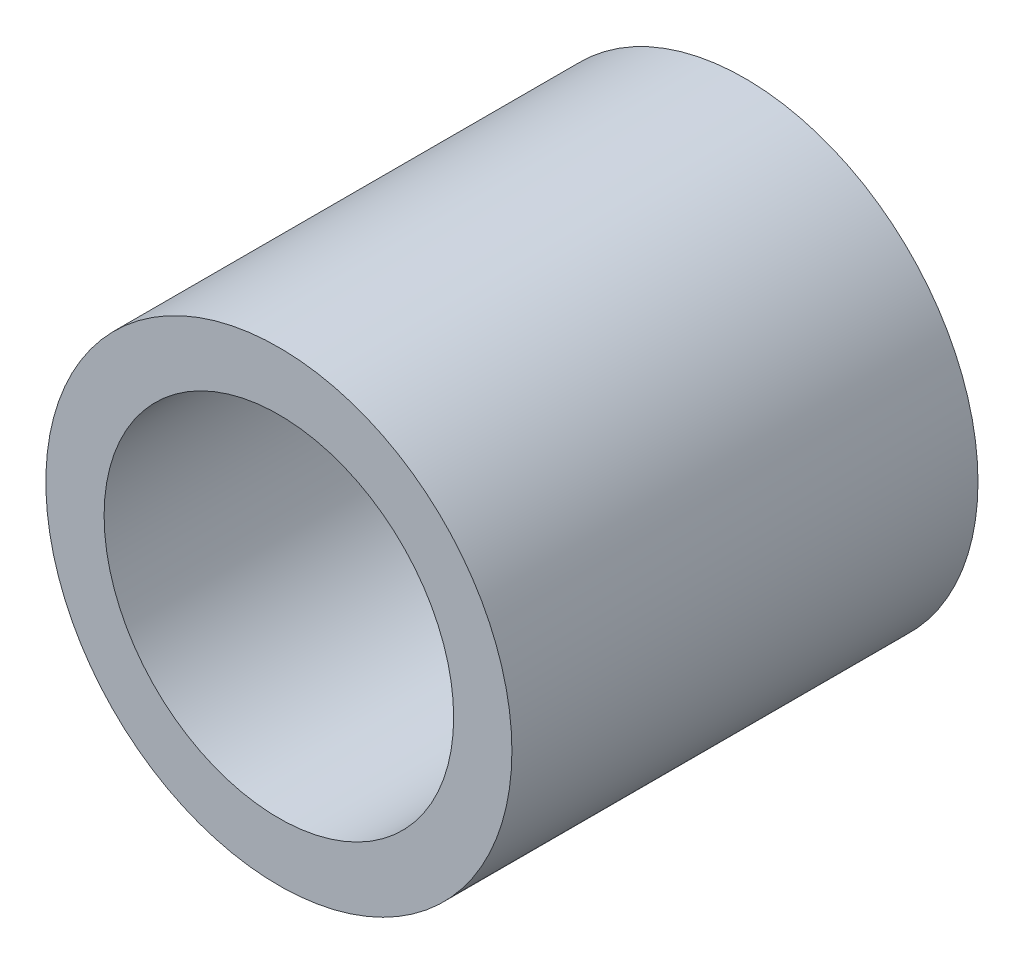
ISO-10303-21;
HEADER;
FILE_DESCRIPTION(('STEP AP214'),'2;1');
FILE_NAME('part.step','',(''),(''),'','','');
FILE_SCHEMA(('AUTOMOTIVE_DESIGN { 1 0 10303 214 1 1 1 1 }'));
ENDSEC;
DATA;
#1=APPLICATION_CONTEXT('core data for automotive mechanical design processes');
#2=APPLICATION_PROTOCOL_DEFINITION('international standard','automotive_design',2000,#1);
#3=PRODUCT_CONTEXT('',#1,'mechanical');
#4=PRODUCT('Part','Part','',(#3));
#5=PRODUCT_RELATED_PRODUCT_CATEGORY('part','',(#4));
#6=PRODUCT_DEFINITION_FORMATION('','',#4);
#7=PRODUCT_DEFINITION_CONTEXT('part definition',#1,'design');
#8=PRODUCT_DEFINITION('design','',#6,#7);
#9=PRODUCT_DEFINITION_SHAPE('','',#8);
#10=(LENGTH_UNIT() NAMED_UNIT(*) SI_UNIT(.MILLI.,.METRE.));
#11=(NAMED_UNIT(*) PLANE_ANGLE_UNIT() SI_UNIT($,.RADIAN.));
#12=(NAMED_UNIT(*) SI_UNIT($,.STERADIAN.) SOLID_ANGLE_UNIT());
#13=UNCERTAINTY_MEASURE_WITH_UNIT(LENGTH_MEASURE(1.E-05),#10,'distance_accuracy_value','');
#14=(GEOMETRIC_REPRESENTATION_CONTEXT(3) GLOBAL_UNCERTAINTY_ASSIGNED_CONTEXT((#13)) GLOBAL_UNIT_ASSIGNED_CONTEXT((#10,
#11,#12)) REPRESENTATION_CONTEXT('',''));
#15=CARTESIAN_POINT('',(0.,0.,0.));
#16=DIRECTION('',(0.,0.,1.));
#17=DIRECTION('',(1.,0.,0.));
#18=AXIS2_PLACEMENT_3D('',#15,#16,#17);
#19=CARTESIAN_POINT('',(0.,0.,4.));
#20=DIRECTION('',(0.,0.,1.));
#21=DIRECTION('',(1.,0.,0.));
#22=AXIS2_PLACEMENT_3D('',#19,#20,#21);
#23=PLANE('',#22);
#24=CARTESIAN_POINT('',(0.,0.,4.));
#25=DIRECTION('',(0.,0.,1.));
#26=DIRECTION('',(1.,0.,0.));
#27=AXIS2_PLACEMENT_3D('',#24,#25,#26);
#28=CIRCLE('',#27,4.);
#29=CARTESIAN_POINT('',(4.,0.,4.));
#30=VERTEX_POINT('',#29);
#31=EDGE_CURVE('E10',#30,#30,#28,.T.);
#32=ORIENTED_EDGE('',*,*,#31,.T.);
#33=EDGE_LOOP('',(#32));
#34=FACE_BOUND('',#33,.T.);
#35=CARTESIAN_POINT('',(0.,0.,4.));
#36=DIRECTION('',(0.,0.,1.));
#37=DIRECTION('',(1.,0.,0.));
#38=AXIS2_PLACEMENT_3D('',#35,#36,#37);
#39=CIRCLE('',#38,3.);
#40=CARTESIAN_POINT('',(3.,0.,4.));
#41=VERTEX_POINT('',#40);
#42=EDGE_CURVE('E41',#41,#41,#39,.T.);
#43=ORIENTED_EDGE('',*,*,#42,.F.);
#44=EDGE_LOOP('',(#43));
#45=FACE_BOUND('',#44,.T.);
#46=ADVANCED_FACE('F30',(#34,#45),#23,.T.);
#47=CARTESIAN_POINT('',(0.,0.,-4.));
#48=DIRECTION('',(0.,0.,1.));
#49=DIRECTION('',(1.,0.,0.));
#50=AXIS2_PLACEMENT_3D('',#47,#48,#49);
#51=PLANE('',#50);
#52=CARTESIAN_POINT('',(0.,0.,-4.));
#53=DIRECTION('',(0.,0.,1.));
#54=DIRECTION('',(1.,0.,0.));
#55=AXIS2_PLACEMENT_3D('',#52,#53,#54);
#56=CIRCLE('',#55,4.);
#57=CARTESIAN_POINT('',(4.,0.,-4.));
#58=VERTEX_POINT('',#57);
#59=EDGE_CURVE('E37',#58,#58,#56,.T.);
#60=ORIENTED_EDGE('',*,*,#59,.F.);
#61=EDGE_LOOP('',(#60));
#62=FACE_BOUND('',#61,.T.);
#63=CARTESIAN_POINT('',(0.,0.,-4.));
#64=DIRECTION('',(0.,0.,1.));
#65=DIRECTION('',(1.,0.,0.));
#66=AXIS2_PLACEMENT_3D('',#63,#64,#65);
#67=CIRCLE('',#66,3.);
#68=CARTESIAN_POINT('',(3.,0.,-4.));
#69=VERTEX_POINT('',#68);
#70=EDGE_CURVE('E45',#69,#69,#67,.T.);
#71=ORIENTED_EDGE('',*,*,#70,.T.);
#72=EDGE_LOOP('',(#71));
#73=FACE_BOUND('',#72,.T.);
#74=ADVANCED_FACE('F51',(#62,#73),#51,.F.);
#75=CARTESIAN_POINT('',(0.,0.,4.));
#76=DIRECTION('',(0.,0.,-1.));
#77=DIRECTION('',(-1.,0.,0.));
#78=AXIS2_PLACEMENT_3D('',#75,#76,#77);
#79=CYLINDRICAL_SURFACE('',#78,4.);
#80=ORIENTED_EDGE('',*,*,#31,.F.);
#81=EDGE_LOOP('',(#80));
#82=FACE_BOUND('',#81,.T.);
#83=ORIENTED_EDGE('',*,*,#59,.T.);
#84=EDGE_LOOP('',(#83));
#85=FACE_BOUND('',#84,.T.);
#86=ADVANCED_FACE('F32',(#82,#85),#79,.T.);
#87=CARTESIAN_POINT('',(0.,0.,4.));
#88=DIRECTION('',(0.,0.,-1.));
#89=DIRECTION('',(-1.,0.,0.));
#90=AXIS2_PLACEMENT_3D('',#87,#88,#89);
#91=CYLINDRICAL_SURFACE('',#90,3.);
#92=ORIENTED_EDGE('',*,*,#42,.T.);
#93=EDGE_LOOP('',(#92));
#94=FACE_BOUND('',#93,.T.);
#95=ORIENTED_EDGE('',*,*,#70,.F.);
#96=EDGE_LOOP('',(#95));
#97=FACE_BOUND('',#96,.T.);
#98=ADVANCED_FACE('F53',(#94,#97),#91,.F.);
#99=CLOSED_SHELL('',(#46,#74,#86,#98));
#100=MANIFOLD_SOLID_BREP('B2',#99);
#101=ADVANCED_BREP_SHAPE_REPRESENTATION('',(#18,#100),#14);
#102=SHAPE_DEFINITION_REPRESENTATION(#9,#101);
ENDSEC;
END-ISO-10303-21;
